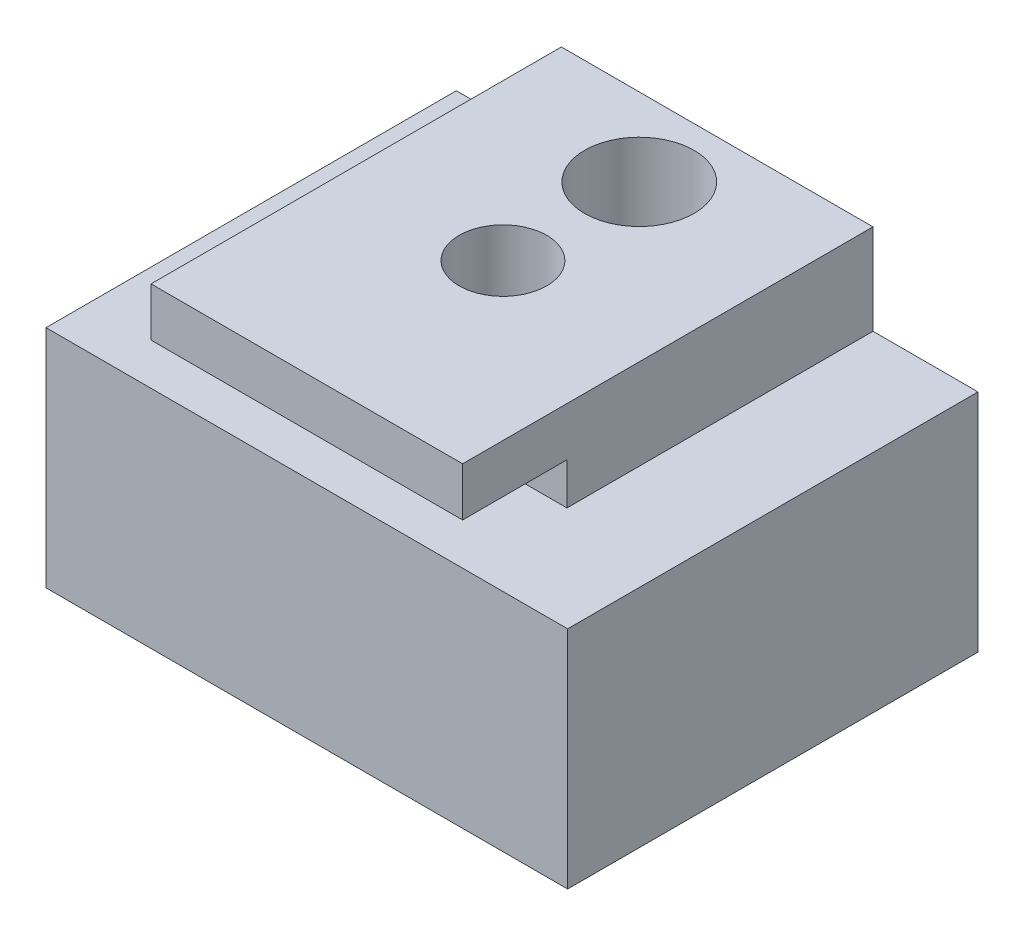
from build123d import *

# Parameters (mm, degrees)
SKETCH1_W                        = 9.525
SKETCH1_H                        = 7.493
EXTRUDE1_DEPTH                   = 2.0574
SKETCH3_W                        = 5.6896
SKETCH3_H                        = 7.493
EXTRUDE2_DEPTH                   = 1.651
M2X0_4_TAPPED_HOLE1_D            = 1.6
SKETCH6_R                        = 0.99949
F_2MM_DOWEL_HOLE_PRESS_FIT_DEPTH = 1.5875
CUT_EXTRUDE1_DEPTH               = 8.104216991
CUT_EXTRUDE1_DEPTH_BACK          = 8.104216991
SKETCH7_W                        = 1.905
SKETCH7_H                        = 0.762


with BuildPart() as part:
    # Sketch1 → Extrude1 (new, symmetric)
    with BuildSketch(Plane(origin=(0, 0, 0), x_dir=(1, 0, 0), z_dir=(0, 1, 0))):
        Rectangle(SKETCH1_W, SKETCH1_H)
    extrude(amount=EXTRUDE1_DEPTH, both=True)

    # Sketch3 → Extrude2 (add)
    with BuildSketch(Plane(origin=(0, 2.0574, 0), x_dir=(-1, 0, 0), z_dir=(0, 1, 0))):
        Rectangle(SKETCH3_W, SKETCH3_H)
    extrude(amount=EXTRUDE2_DEPTH)

    # M2x0.4 Tapped Hole1 (through all)
    with Locations(Plane(origin=(0, 3.7084, 0), x_dir=(-1, 0, 0), z_dir=(0, 1, 0))):
        with Locations((0, 0.1651)):
            Hole(M2X0_4_TAPPED_HOLE1_D / 2)

    # Sketch6 → 2mm Dowel Hole - Press Fit (cut)
    with BuildSketch(Plane(origin=(0, 3.7084, 0), x_dir=(-1, 0, 0), z_dir=(0, 1, 0))):
        with Locations(Location((0, -2.3241, 0), (0, 0, 90))):
            Circle(SKETCH6_R)
    extrude(amount=-F_2MM_DOWEL_HOLE_PRESS_FIT_DEPTH, mode=Mode.SUBTRACT)

    # Sketch7 → Cut-Extrude1 (cut, two sides: drawn at the far end of the back side and taken through both)
    with BuildSketch(Plane(origin=(0, 0, 0), x_dir=(0, 0, -1), z_dir=(1, 0, 0)).offset(-CUT_EXTRUDE1_DEPTH_BACK)):
        with Locations((-2.794, 2.4384)):
            Rectangle(SKETCH7_W, SKETCH7_H)
    extrude(amount=CUT_EXTRUDE1_DEPTH + CUT_EXTRUDE1_DEPTH_BACK, mode=Mode.SUBTRACT)


solid = part.part
